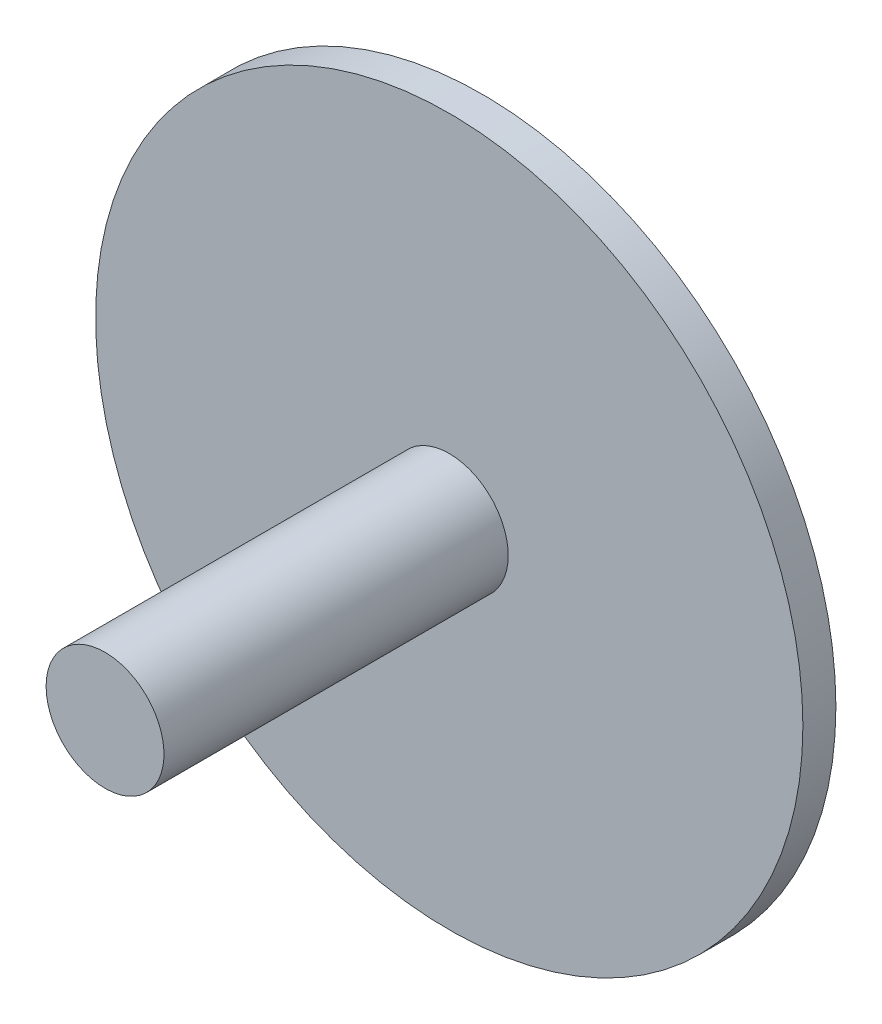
from build123d import *

# Parameters (mm, degrees)
SKETCH2_R           = 19.05
BOSS_EXTRUDE1_DEPTH = 1.778


with BuildPart() as part:
    # Sketch1 → Revolve1 (revolve)
    with BuildSketch(Plane(origin=(0, 0, 0), x_dir=(1, 0, 0), z_dir=(0, 1, 0))):
        Polygon((0, 0), (5.55625, 0), (5.55625, -25.4), (2.38125, -25.4), (2.38125, -5.08), (0, -5.08), align=None)
    revolve(axis=Axis((5.55625, 0, 0), (0, 0, 1)))

    # Sketch2 → Boss-Extrude1 (add)
    with BuildSketch(Plane.XY.offset(5.08)):
        with Locations((5.55625, 0)):
            Circle(SKETCH2_R)
    extrude(amount=BOSS_EXTRUDE1_DEPTH)


solid = part.part
